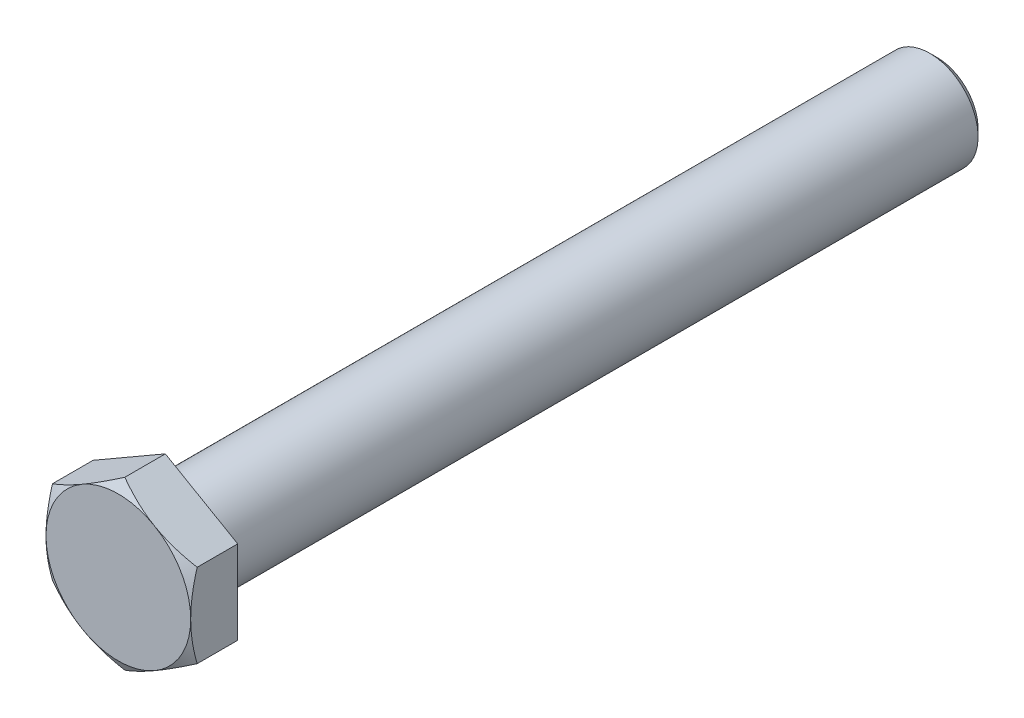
from build123d import *

# Parameters (mm, degrees)
BOSS_EXTRUDE1_DEPTH = 15.478125
SKETCH5_OUTSIDE_W   = 1050.878
SKETCH5_OUTSIDE_H   = 1058.246
SKETCH5_OUTSIDE_R   = 23.8125
CUT_EXTRUDE1_DEPTH  = 272.921940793
CUT_EXTRUDE1_DRAFT  = -60
CHAMFER1_SIZE       = 0.635


with BuildPart() as part:
    # Sketch3 → Revolve1 (revolve)
    with BuildSketch(Plane(origin=(0, 0, 0), x_dir=(0, 0, -1), z_dir=(1, 0, 0)), mode=Mode.PRIVATE) as revolve1_sk:
        Polygon((-134.7390625, 0), (-134.7390625, 23.8125), (-119.2609375, 23.8125), (-119.2609375, 15.875), (132.3578125, 15.875), (134.7390625, 13.49375), (134.7390625, 0), align=None)
    revolve(revolve1_sk.sketch.rotate(Axis((0, 0, -134.7390625), (0, 0, 1)), 90), axis=Axis((0, 0, -134.7390625), (0, 0, 1)))

    # Sketch4 → Boss-Extrude1 (add)
    with BuildSketch(Plane.XY.offset(134.7390625)):
        Polygon((0, -27.49630657), (23.8125, -13.748153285), (23.8125, 13.748153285), (0, 27.49630657), (-23.8125, 13.748153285), (-23.8125, -13.748153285), align=None)
    extrude(amount=-BOSS_EXTRUDE1_DEPTH)


with BuildPart() as cut_extrude1_tool:
    # Sketch5 outside → Cut-Extrude1 (with draft: the straight prism first)
    with BuildSketch(Plane.XY.offset(134.7390625)):
        Rectangle(SKETCH5_OUTSIDE_W, SKETCH5_OUTSIDE_H)
        Circle(SKETCH5_OUTSIDE_R, mode=Mode.SUBTRACT)
    extrude(amount=-CUT_EXTRUDE1_DEPTH)
    # Cut-Extrude1: the draft: its side faces are tilted about the plane it starts from
    cut_extrude1_sides = [cut_extrude1_tool.faces().sort_by_distance(p)[0] for p in [
        (0, -529.123, -1.721907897),
        (525.439, 0, -1.721907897),
        (0, 529.123, -1.721907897),
        (-525.439, 0, -1.721907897),
        (-23.8125, 0, -1.721907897),
    ]]
    draft(cut_extrude1_sides, Plane.XY.offset(134.7390625), CUT_EXTRUDE1_DRAFT)


with BuildPart() as part_1:
    add(part.part)

    # Cut-Extrude1: cut by cut_extrude1_tool
    add(cut_extrude1_tool.part, mode=Mode.SUBTRACT)

    # Chamfer1
    chamfer1_edges = [part_1.edges().sort_by_distance(p)[0] for p in [
        (15.875, 0, 119.2609375),
    ]]
    chamfer(chamfer1_edges, length=CHAMFER1_SIZE)


solid = part_1.part
